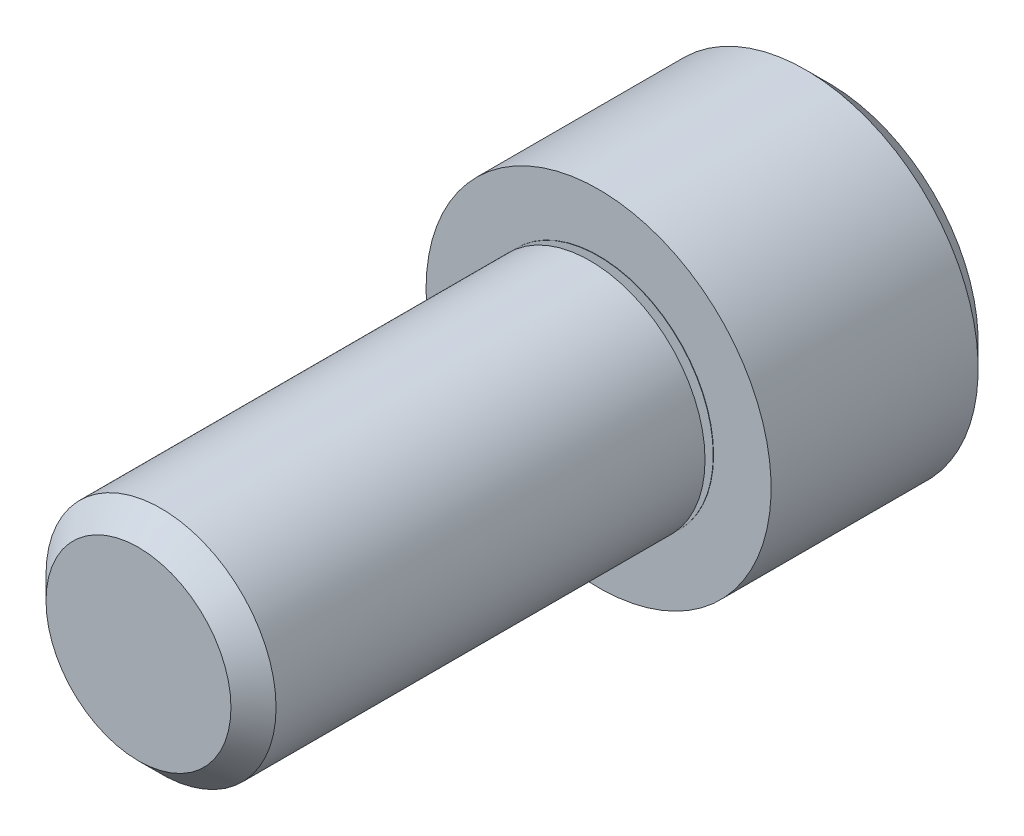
ISO-10303-21;
HEADER;
FILE_DESCRIPTION(('STEP AP214'),'2;1');
FILE_NAME('part.step','',(''),(''),'','','');
FILE_SCHEMA(('AUTOMOTIVE_DESIGN { 1 0 10303 214 1 1 1 1 }'));
ENDSEC;
DATA;
#1=APPLICATION_CONTEXT('core data for automotive mechanical design processes');
#2=APPLICATION_PROTOCOL_DEFINITION('international standard','automotive_design',2000,#1);
#3=PRODUCT_CONTEXT('',#1,'mechanical');
#4=PRODUCT('Part','Part','',(#3));
#5=PRODUCT_RELATED_PRODUCT_CATEGORY('part','',(#4));
#6=PRODUCT_DEFINITION_FORMATION('','',#4);
#7=PRODUCT_DEFINITION_CONTEXT('part definition',#1,'design');
#8=PRODUCT_DEFINITION('design','',#6,#7);
#9=PRODUCT_DEFINITION_SHAPE('','',#8);
#10=(LENGTH_UNIT() NAMED_UNIT(*) SI_UNIT(.MILLI.,.METRE.));
#11=(NAMED_UNIT(*) PLANE_ANGLE_UNIT() SI_UNIT($,.RADIAN.));
#12=(NAMED_UNIT(*) SI_UNIT($,.STERADIAN.) SOLID_ANGLE_UNIT());
#13=UNCERTAINTY_MEASURE_WITH_UNIT(LENGTH_MEASURE(1.E-05),#10,'distance_accuracy_value','');
#14=(GEOMETRIC_REPRESENTATION_CONTEXT(3) GLOBAL_UNCERTAINTY_ASSIGNED_CONTEXT((#13)) GLOBAL_UNIT_ASSIGNED_CONTEXT((#10,
#11,#12)) REPRESENTATION_CONTEXT('',''));
#15=CARTESIAN_POINT('',(0.,0.,0.));
#16=DIRECTION('',(0.,0.,1.));
#17=DIRECTION('',(1.,0.,0.));
#18=AXIS2_PLACEMENT_3D('',#15,#16,#17);
#19=CARTESIAN_POINT('',(0.,0.,-6.35));
#20=DIRECTION('',(0.,0.,1.));
#21=DIRECTION('',(1.,0.,0.));
#22=AXIS2_PLACEMENT_3D('',#19,#20,#21);
#23=PLANE('',#22);
#24=DIRECTION('',(-0.5,-0.866025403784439,0.));
#25=VECTOR('',#24,1.);
#26=CARTESIAN_POINT('',(2.74963065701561,0.,-6.35));
#27=LINE('',#26,#25);
#28=CARTESIAN_POINT('',(2.74963065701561,0.,-6.35));
#29=VERTEX_POINT('',#28);
#30=CARTESIAN_POINT('',(1.37481532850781,-2.38125,-6.35));
#31=VERTEX_POINT('',#30);
#32=EDGE_CURVE('E147',#29,#31,#27,.T.);
#33=ORIENTED_EDGE('',*,*,#32,.F.);
#34=DIRECTION('',(0.499999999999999,-0.866025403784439,0.));
#35=VECTOR('',#34,1.);
#36=CARTESIAN_POINT('',(1.37481532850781,2.38125,-6.35));
#37=LINE('',#36,#35);
#38=CARTESIAN_POINT('',(1.37481532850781,2.38125,-6.35));
#39=VERTEX_POINT('',#38);
#40=EDGE_CURVE('E66',#39,#29,#37,.T.);
#41=ORIENTED_EDGE('',*,*,#40,.F.);
#42=DIRECTION('',(1.,0.,0.));
#43=VECTOR('',#42,1.);
#44=CARTESIAN_POINT('',(-1.37481532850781,2.38125,-6.35));
#45=LINE('',#44,#43);
#46=CARTESIAN_POINT('',(-1.37481532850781,2.38125,-6.35));
#47=VERTEX_POINT('',#46);
#48=EDGE_CURVE('E160',#47,#39,#45,.T.);
#49=ORIENTED_EDGE('',*,*,#48,.F.);
#50=DIRECTION('',(0.5,0.866025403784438,0.));
#51=VECTOR('',#50,1.);
#52=CARTESIAN_POINT('',(-2.74963065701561,0.,-6.35));
#53=LINE('',#52,#51);
#54=CARTESIAN_POINT('',(-2.74963065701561,0.,-6.35));
#55=VERTEX_POINT('',#54);
#56=EDGE_CURVE('E157',#55,#47,#53,.T.);
#57=ORIENTED_EDGE('',*,*,#56,.F.);
#58=DIRECTION('',(-0.5,0.866025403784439,0.));
#59=VECTOR('',#58,1.);
#60=CARTESIAN_POINT('',(-1.37481532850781,-2.38125,-6.35));
#61=LINE('',#60,#59);
#62=CARTESIAN_POINT('',(-1.37481532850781,-2.38125,-6.35));
#63=VERTEX_POINT('',#62);
#64=EDGE_CURVE('E114',#63,#55,#61,.T.);
#65=ORIENTED_EDGE('',*,*,#64,.F.);
#66=DIRECTION('',(-1.,0.,0.));
#67=VECTOR('',#66,1.);
#68=CARTESIAN_POINT('',(1.37481532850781,-2.38125,-6.35));
#69=LINE('',#68,#67);
#70=EDGE_CURVE('E151',#31,#63,#69,.T.);
#71=ORIENTED_EDGE('',*,*,#70,.F.);
#72=EDGE_LOOP('',(#33,#41,#49,#57,#65,#71));
#73=FACE_BOUND('',#72,.T.);
#74=CARTESIAN_POINT('',(0.,0.,-6.35));
#75=DIRECTION('',(0.,0.,-1.));
#76=DIRECTION('',(-1.,0.,0.));
#77=AXIS2_PLACEMENT_3D('',#74,#75,#76);
#78=CIRCLE('',#77,4.1275);
#79=CARTESIAN_POINT('',(-4.1275,0.,-6.35));
#80=VERTEX_POINT('',#79);
#81=EDGE_CURVE('E166',#80,#80,#78,.T.);
#82=ORIENTED_EDGE('',*,*,#81,.T.);
#83=EDGE_LOOP('',(#82));
#84=FACE_BOUND('',#83,.T.);
#85=ADVANCED_FACE('F51',(#73,#84),#23,.F.);
#86=CARTESIAN_POINT('',(-2.55269999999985,0.,12.7));
#87=DIRECTION('',(0.,0.,-1.));
#88=DIRECTION('',(-1.,0.,0.));
#89=AXIS2_PLACEMENT_3D('',#86,#87,#88);
#90=PLANE('',#89);
#91=CARTESIAN_POINT('',(0.,0.,12.7));
#92=DIRECTION('',(0.,0.,-1.));
#93=DIRECTION('',(-1.,0.,0.));
#94=AXIS2_PLACEMENT_3D('',#91,#92,#93);
#95=CIRCLE('',#94,2.55270000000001);
#96=CARTESIAN_POINT('',(-2.55270000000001,0.,12.7));
#97=VERTEX_POINT('',#96);
#98=EDGE_CURVE('E11',#97,#97,#95,.T.);
#99=ORIENTED_EDGE('',*,*,#98,.F.);
#100=EDGE_LOOP('',(#99));
#101=FACE_BOUND('',#100,.T.);
#102=ADVANCED_FACE('F216',(#101),#90,.F.);
#103=CARTESIAN_POINT('',(0.,0.,12.7));
#104=DIRECTION('',(0.,0.,-1.));
#105=DIRECTION('',(-1.,0.,0.));
#106=AXIS2_PLACEMENT_3D('',#103,#104,#105);
#107=CONICAL_SURFACE('',#106,2.55270000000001,0.785398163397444);
#108=CARTESIAN_POINT('',(0.,0.,12.0777));
#109=DIRECTION('',(0.,0.,-1.));
#110=DIRECTION('',(-1.,0.,0.));
#111=AXIS2_PLACEMENT_3D('',#108,#109,#110);
#112=CIRCLE('',#111,3.17500000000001);
#113=CARTESIAN_POINT('',(-3.17500000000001,0.,12.0777));
#114=VERTEX_POINT('',#113);
#115=EDGE_CURVE('E59',#114,#114,#112,.T.);
#116=ORIENTED_EDGE('',*,*,#115,.F.);
#117=EDGE_LOOP('',(#116));
#118=FACE_BOUND('',#117,.T.);
#119=ORIENTED_EDGE('',*,*,#98,.T.);
#120=EDGE_LOOP('',(#119));
#121=FACE_BOUND('',#120,.T.);
#122=ADVANCED_FACE('F213',(#118,#121),#107,.T.);
#123=CARTESIAN_POINT('',(0.,0.,-10.585154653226));
#124=DIRECTION('',(0.,0.,-1.));
#125=DIRECTION('',(-1.,0.,0.));
#126=AXIS2_PLACEMENT_3D('',#123,#124,#125);
#127=CYLINDRICAL_SURFACE('',#126,3.17500000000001);
#128=CARTESIAN_POINT('',(0.,0.,0.236498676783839));
#129=DIRECTION('',(0.,0.,-1.));
#130=DIRECTION('',(-1.,0.,0.));
#131=AXIS2_PLACEMENT_3D('',#128,#129,#130);
#132=CIRCLE('',#131,3.17500000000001);
#133=CARTESIAN_POINT('',(-3.17500000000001,0.,0.236498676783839));
#134=VERTEX_POINT('',#133);
#135=EDGE_CURVE('E203',#134,#134,#132,.T.);
#136=ORIENTED_EDGE('',*,*,#135,.F.);
#137=EDGE_LOOP('',(#136));
#138=FACE_BOUND('',#137,.T.);
#139=ORIENTED_EDGE('',*,*,#115,.T.);
#140=EDGE_LOOP('',(#139));
#141=FACE_BOUND('',#140,.T.);
#142=ADVANCED_FACE('F211',(#138,#141),#127,.T.);
#143=CARTESIAN_POINT('',(0.,0.,0.236498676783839));
#144=DIRECTION('',(0.,0.,1.));
#145=DIRECTION('',(1.,0.,0.));
#146=AXIS2_PLACEMENT_3D('',#143,#144,#145);
#147=CONICAL_SURFACE('',#146,3.17500000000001,1.22173047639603);
#148=CARTESIAN_POINT('',(0.,0.,0.0487938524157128));
#149=DIRECTION('',(0.,0.,-1.));
#150=DIRECTION('',(-1.,0.,0.));
#151=AXIS2_PLACEMENT_3D('',#148,#149,#150);
#152=CIRCLE('',#151,2.65928523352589);
#153=CARTESIAN_POINT('',(-2.65928523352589,0.,0.0487938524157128));
#154=VERTEX_POINT('',#153);
#155=EDGE_CURVE('E199',#154,#154,#152,.T.);
#156=ORIENTED_EDGE('',*,*,#155,.F.);
#157=EDGE_LOOP('',(#156));
#158=FACE_BOUND('',#157,.T.);
#159=ORIENTED_EDGE('',*,*,#135,.T.);
#160=EDGE_LOOP('',(#159));
#161=FACE_BOUND('',#160,.T.);
#162=ADVANCED_FACE('F228',(#158,#161),#147,.T.);
#163=CARTESIAN_POINT('',(0.,0.,0.0300000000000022));
#164=DIRECTION('',(0.,0.,-1.));
#165=DIRECTION('',(-1.,0.,0.));
#166=AXIS2_PLACEMENT_3D('',#163,#164,#165);
#167=TOROIDAL_SURFACE('',#166,2.6661256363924,0.0199999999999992);
#168=CARTESIAN_POINT('',(0.,0.,0.0100000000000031));
#169=DIRECTION('',(0.,0.,-1.));
#170=DIRECTION('',(-1.,0.,0.));
#171=AXIS2_PLACEMENT_3D('',#168,#169,#170);
#172=CIRCLE('',#171,2.6661256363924);
#173=CARTESIAN_POINT('',(-2.6661256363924,0.,0.0100000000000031));
#174=VERTEX_POINT('',#173);
#175=EDGE_CURVE('E195',#174,#174,#172,.T.);
#176=ORIENTED_EDGE('',*,*,#175,.F.);
#177=EDGE_LOOP('',(#176));
#178=FACE_BOUND('',#177,.T.);
#179=ORIENTED_EDGE('',*,*,#155,.T.);
#180=EDGE_LOOP('',(#179));
#181=FACE_BOUND('',#180,.T.);
#182=ADVANCED_FACE('F232',(#178,#181),#167,.F.);
#183=CARTESIAN_POINT('',(-3.17500000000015,0.,0.00999999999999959));
#184=DIRECTION('',(0.,0.,-1.));
#185=DIRECTION('',(-1.,0.,0.));
#186=AXIS2_PLACEMENT_3D('',#183,#184,#185);
#187=PLANE('',#186);
#188=CARTESIAN_POINT('',(0.,0.,0.00999999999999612));
#189=DIRECTION('',(0.,0.,-1.));
#190=DIRECTION('',(-1.,0.,0.));
#191=AXIS2_PLACEMENT_3D('',#188,#189,#190);
#192=CIRCLE('',#191,3.175);
#193=CARTESIAN_POINT('',(-3.175,0.,0.00999999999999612));
#194=VERTEX_POINT('',#193);
#195=EDGE_CURVE('E191',#194,#194,#192,.T.);
#196=ORIENTED_EDGE('',*,*,#195,.F.);
#197=EDGE_LOOP('',(#196));
#198=FACE_BOUND('',#197,.T.);
#199=ORIENTED_EDGE('',*,*,#175,.T.);
#200=EDGE_LOOP('',(#199));
#201=FACE_BOUND('',#200,.T.);
#202=ADVANCED_FACE('F236',(#198,#201),#187,.F.);
#203=CARTESIAN_POINT('',(0.,0.,-10.585154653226));
#204=DIRECTION('',(0.,0.,-1.));
#205=DIRECTION('',(-1.,0.,0.));
#206=AXIS2_PLACEMENT_3D('',#203,#204,#205);
#207=CYLINDRICAL_SURFACE('',#206,3.175);
#208=CARTESIAN_POINT('',(0.,0.,0.));
#209=DIRECTION('',(0.,0.,-1.));
#210=DIRECTION('',(-1.,0.,0.));
#211=AXIS2_PLACEMENT_3D('',#208,#209,#210);
#212=CIRCLE('',#211,3.175);
#213=CARTESIAN_POINT('',(-3.175,0.,0.));
#214=VERTEX_POINT('',#213);
#215=EDGE_CURVE('E187',#214,#214,#212,.T.);
#216=ORIENTED_EDGE('',*,*,#215,.F.);
#217=EDGE_LOOP('',(#216));
#218=FACE_BOUND('',#217,.T.);
#219=ORIENTED_EDGE('',*,*,#195,.T.);
#220=EDGE_LOOP('',(#219));
#221=FACE_BOUND('',#220,.T.);
#222=ADVANCED_FACE('F240',(#218,#221),#207,.T.);
#223=CARTESIAN_POINT('',(-4.7625,0.,0.));
#224=DIRECTION('',(0.,0.,-1.));
#225=DIRECTION('',(-1.,0.,0.));
#226=AXIS2_PLACEMENT_3D('',#223,#224,#225);
#227=PLANE('',#226);
#228=CARTESIAN_POINT('',(0.,0.,0.));
#229=DIRECTION('',(0.,0.,-1.));
#230=DIRECTION('',(-1.,0.,0.));
#231=AXIS2_PLACEMENT_3D('',#228,#229,#230);
#232=CIRCLE('',#231,4.7625);
#233=CARTESIAN_POINT('',(-4.7625,0.,0.));
#234=VERTEX_POINT('',#233);
#235=EDGE_CURVE('E183',#234,#234,#232,.T.);
#236=ORIENTED_EDGE('',*,*,#235,.F.);
#237=EDGE_LOOP('',(#236));
#238=FACE_BOUND('',#237,.T.);
#239=ORIENTED_EDGE('',*,*,#215,.T.);
#240=EDGE_LOOP('',(#239));
#241=FACE_BOUND('',#240,.T.);
#242=ADVANCED_FACE('F244',(#238,#241),#227,.F.);
#243=CARTESIAN_POINT('',(0.,0.,-10.585154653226));
#244=DIRECTION('',(0.,0.,-1.));
#245=DIRECTION('',(-1.,0.,0.));
#246=AXIS2_PLACEMENT_3D('',#243,#244,#245);
#247=CYLINDRICAL_SURFACE('',#246,4.7625);
#248=CARTESIAN_POINT('',(0.,0.,-5.715));
#249=DIRECTION('',(0.,0.,-1.));
#250=DIRECTION('',(-1.,0.,0.));
#251=AXIS2_PLACEMENT_3D('',#248,#249,#250);
#252=CIRCLE('',#251,4.7625);
#253=CARTESIAN_POINT('',(-4.7625,0.,-5.715));
#254=VERTEX_POINT('',#253);
#255=EDGE_CURVE('E179',#254,#254,#252,.T.);
#256=ORIENTED_EDGE('',*,*,#255,.F.);
#257=EDGE_LOOP('',(#256));
#258=FACE_BOUND('',#257,.T.);
#259=ORIENTED_EDGE('',*,*,#235,.T.);
#260=EDGE_LOOP('',(#259));
#261=FACE_BOUND('',#260,.T.);
#262=ADVANCED_FACE('F248',(#258,#261),#247,.T.);
#263=CARTESIAN_POINT('',(0.,0.,-5.715));
#264=DIRECTION('',(0.,0.,1.));
#265=DIRECTION('',(1.,0.,0.));
#266=AXIS2_PLACEMENT_3D('',#263,#264,#265);
#267=CONICAL_SURFACE('',#266,4.7625,0.785398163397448);
#268=ORIENTED_EDGE('',*,*,#81,.F.);
#269=EDGE_LOOP('',(#268));
#270=FACE_BOUND('',#269,.T.);
#271=ORIENTED_EDGE('',*,*,#255,.T.);
#272=EDGE_LOOP('',(#271));
#273=FACE_BOUND('',#272,.T.);
#274=ADVANCED_FACE('F252',(#270,#273),#267,.T.);
#275=CARTESIAN_POINT('',(1.37481532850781,2.38125,-3.175));
#276=DIRECTION('',(0.866025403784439,0.499999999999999,0.));
#277=DIRECTION('',(-0.5,0.866025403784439,0.));
#278=AXIS2_PLACEMENT_3D('',#275,#276,#277);
#279=PLANE('',#278);
#280=ORIENTED_EDGE('',*,*,#40,.T.);
#281=DIRECTION('',(0.,0.,-1.));
#282=VECTOR('',#281,1.);
#283=CARTESIAN_POINT('',(2.74963065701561,0.,-3.175));
#284=LINE('',#283,#282);
#285=CARTESIAN_POINT('',(2.74963065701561,0.,-3.175));
#286=VERTEX_POINT('',#285);
#287=EDGE_CURVE('E96',#286,#29,#284,.T.);
#288=ORIENTED_EDGE('',*,*,#287,.F.);
#289=DIRECTION('',(0.499999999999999,-0.866025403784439,0.));
#290=VECTOR('',#289,1.);
#291=CARTESIAN_POINT('',(1.37481532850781,2.38125,-3.175));
#292=LINE('',#291,#290);
#293=CARTESIAN_POINT('',(1.37481532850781,2.38125,-3.175));
#294=VERTEX_POINT('',#293);
#295=EDGE_CURVE('E163',#294,#286,#292,.T.);
#296=ORIENTED_EDGE('',*,*,#295,.F.);
#297=DIRECTION('',(0.,0.,-1.));
#298=VECTOR('',#297,1.);
#299=CARTESIAN_POINT('',(1.37481532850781,2.38125,-3.175));
#300=LINE('',#299,#298);
#301=EDGE_CURVE('E74',#294,#39,#300,.T.);
#302=ORIENTED_EDGE('',*,*,#301,.T.);
#303=EDGE_LOOP('',(#280,#288,#296,#302));
#304=FACE_BOUND('',#303,.T.);
#305=ADVANCED_FACE('F256',(#304),#279,.F.);
#306=CARTESIAN_POINT('',(-1.37481532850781,2.38125,-3.175));
#307=DIRECTION('',(0.,1.,0.));
#308=DIRECTION('',(-1.,0.,0.));
#309=AXIS2_PLACEMENT_3D('',#306,#307,#308);
#310=PLANE('',#309);
#311=ORIENTED_EDGE('',*,*,#48,.T.);
#312=ORIENTED_EDGE('',*,*,#301,.F.);
#313=DIRECTION('',(1.,0.,0.));
#314=VECTOR('',#313,1.);
#315=CARTESIAN_POINT('',(-1.37481532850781,2.38125,-3.175));
#316=LINE('',#315,#314);
#317=CARTESIAN_POINT('',(-1.37481532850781,2.38125,-3.175));
#318=VERTEX_POINT('',#317);
#319=EDGE_CURVE('E128',#318,#294,#316,.T.);
#320=ORIENTED_EDGE('',*,*,#319,.F.);
#321=DIRECTION('',(0.,0.,-1.));
#322=VECTOR('',#321,1.);
#323=CARTESIAN_POINT('',(-1.37481532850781,2.38125,-3.175));
#324=LINE('',#323,#322);
#325=EDGE_CURVE('E119',#318,#47,#324,.T.);
#326=ORIENTED_EDGE('',*,*,#325,.T.);
#327=EDGE_LOOP('',(#311,#312,#320,#326));
#328=FACE_BOUND('',#327,.T.);
#329=ADVANCED_FACE('F260',(#328),#310,.F.);
#330=CARTESIAN_POINT('',(-2.74963065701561,0.,-3.175));
#331=DIRECTION('',(-0.866025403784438,0.5,0.));
#332=DIRECTION('',(-0.5,-0.866025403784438,0.));
#333=AXIS2_PLACEMENT_3D('',#330,#331,#332);
#334=PLANE('',#333);
#335=ORIENTED_EDGE('',*,*,#56,.T.);
#336=ORIENTED_EDGE('',*,*,#325,.F.);
#337=DIRECTION('',(0.5,0.866025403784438,0.));
#338=VECTOR('',#337,1.);
#339=CARTESIAN_POINT('',(-2.74963065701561,0.,-3.175));
#340=LINE('',#339,#338);
#341=CARTESIAN_POINT('',(-2.74963065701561,0.,-3.175));
#342=VERTEX_POINT('',#341);
#343=EDGE_CURVE('E123',#342,#318,#340,.T.);
#344=ORIENTED_EDGE('',*,*,#343,.F.);
#345=DIRECTION('',(0.,0.,-1.));
#346=VECTOR('',#345,1.);
#347=CARTESIAN_POINT('',(-2.74963065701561,0.,-3.175));
#348=LINE('',#347,#346);
#349=EDGE_CURVE('E107',#342,#55,#348,.T.);
#350=ORIENTED_EDGE('',*,*,#349,.T.);
#351=EDGE_LOOP('',(#335,#336,#344,#350));
#352=FACE_BOUND('',#351,.T.);
#353=ADVANCED_FACE('F124',(#352),#334,.F.);
#354=CARTESIAN_POINT('',(-1.37481532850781,-2.38125,-3.175));
#355=DIRECTION('',(-0.866025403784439,-0.5,0.));
#356=DIRECTION('',(0.5,-0.866025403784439,0.));
#357=AXIS2_PLACEMENT_3D('',#354,#355,#356);
#358=PLANE('',#357);
#359=ORIENTED_EDGE('',*,*,#64,.T.);
#360=ORIENTED_EDGE('',*,*,#349,.F.);
#361=DIRECTION('',(-0.5,0.866025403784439,0.));
#362=VECTOR('',#361,1.);
#363=CARTESIAN_POINT('',(-1.37481532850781,-2.38125,-3.175));
#364=LINE('',#363,#362);
#365=CARTESIAN_POINT('',(-1.37481532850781,-2.38125,-3.175));
#366=VERTEX_POINT('',#365);
#367=EDGE_CURVE('E111',#366,#342,#364,.T.);
#368=ORIENTED_EDGE('',*,*,#367,.F.);
#369=DIRECTION('',(0.,0.,-1.));
#370=VECTOR('',#369,1.);
#371=CARTESIAN_POINT('',(-1.37481532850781,-2.38125,-3.175));
#372=LINE('',#371,#370);
#373=EDGE_CURVE('E120',#366,#63,#372,.T.);
#374=ORIENTED_EDGE('',*,*,#373,.T.);
#375=EDGE_LOOP('',(#359,#360,#368,#374));
#376=FACE_BOUND('',#375,.T.);
#377=ADVANCED_FACE('F109',(#376),#358,.F.);
#378=CARTESIAN_POINT('',(1.37481532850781,-2.38125,-3.175));
#379=DIRECTION('',(0.,-1.,0.));
#380=DIRECTION('',(0.,0.,-1.));
#381=AXIS2_PLACEMENT_3D('',#378,#379,#380);
#382=PLANE('',#381);
#383=ORIENTED_EDGE('',*,*,#70,.T.);
#384=ORIENTED_EDGE('',*,*,#373,.F.);
#385=DIRECTION('',(-1.,0.,0.));
#386=VECTOR('',#385,1.);
#387=CARTESIAN_POINT('',(1.37481532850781,-2.38125,-3.175));
#388=LINE('',#387,#386);
#389=CARTESIAN_POINT('',(1.37481532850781,-2.38125,-3.175));
#390=VERTEX_POINT('',#389);
#391=EDGE_CURVE('E134',#390,#366,#388,.T.);
#392=ORIENTED_EDGE('',*,*,#391,.F.);
#393=DIRECTION('',(0.,0.,-1.));
#394=VECTOR('',#393,1.);
#395=CARTESIAN_POINT('',(1.37481532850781,-2.38125,-3.175));
#396=LINE('',#395,#394);
#397=EDGE_CURVE('E171',#390,#31,#396,.T.);
#398=ORIENTED_EDGE('',*,*,#397,.T.);
#399=EDGE_LOOP('',(#383,#384,#392,#398));
#400=FACE_BOUND('',#399,.T.);
#401=ADVANCED_FACE('F264',(#400),#382,.F.);
#402=CARTESIAN_POINT('',(2.74963065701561,0.,-3.175));
#403=DIRECTION('',(0.866025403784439,-0.5,0.));
#404=DIRECTION('',(0.5,0.866025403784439,0.));
#405=AXIS2_PLACEMENT_3D('',#402,#403,#404);
#406=PLANE('',#405);
#407=ORIENTED_EDGE('',*,*,#32,.T.);
#408=ORIENTED_EDGE('',*,*,#397,.F.);
#409=DIRECTION('',(-0.5,-0.866025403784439,0.));
#410=VECTOR('',#409,1.);
#411=CARTESIAN_POINT('',(2.74963065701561,0.,-3.175));
#412=LINE('',#411,#410);
#413=EDGE_CURVE('E139',#286,#390,#412,.T.);
#414=ORIENTED_EDGE('',*,*,#413,.F.);
#415=ORIENTED_EDGE('',*,*,#287,.T.);
#416=EDGE_LOOP('',(#407,#408,#414,#415));
#417=FACE_BOUND('',#416,.T.);
#418=ADVANCED_FACE('F261',(#417),#406,.F.);
#419=CARTESIAN_POINT('',(1.37481532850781,2.38125,-3.175));
#420=DIRECTION('',(0.,0.,1.));
#421=DIRECTION('',(1.,0.,0.));
#422=AXIS2_PLACEMENT_3D('',#419,#420,#421);
#423=PLANE('',#422);
#424=ORIENTED_EDGE('',*,*,#295,.T.);
#425=ORIENTED_EDGE('',*,*,#413,.T.);
#426=ORIENTED_EDGE('',*,*,#391,.T.);
#427=ORIENTED_EDGE('',*,*,#367,.T.);
#428=ORIENTED_EDGE('',*,*,#343,.T.);
#429=ORIENTED_EDGE('',*,*,#319,.T.);
#430=EDGE_LOOP('',(#424,#425,#426,#427,#428,#429));
#431=FACE_BOUND('',#430,.T.);
#432=ADVANCED_FACE('F131',(#431),#423,.F.);
#433=CLOSED_SHELL('',(#85,#102,#122,#142,#162,#182,#202,#222,#242,#262,#274,#305,#329,#353,#377,
#401,#418,#432));
#434=MANIFOLD_SOLID_BREP('B2',#433);
#435=ADVANCED_BREP_SHAPE_REPRESENTATION('',(#18,#434),#14);
#436=SHAPE_DEFINITION_REPRESENTATION(#9,#435);
ENDSEC;
END-ISO-10303-21;
